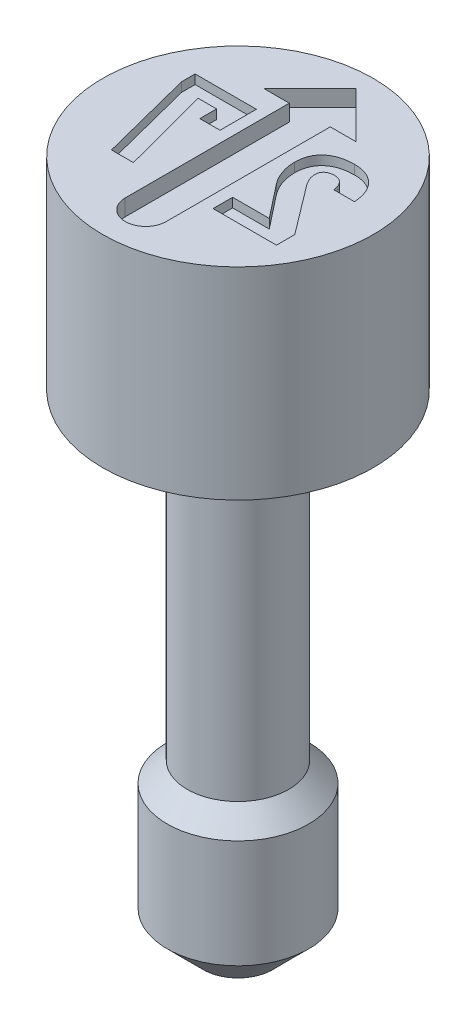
from build123d import *

# Parameters (mm, degrees)
CUT_EXTRUDE1_DEPTH = 0.4064
CUT_EXTRUDE2_DEPTH = 0.2286


with BuildPart() as part:
    # Sketch1 → Revolve1 (revolve)
    with BuildSketch(Plane.XY, mode=Mode.PRIVATE) as revolve1_sk:
        Polygon((0, 17.018), (3.3528, 17.018), (3.3528, 12.0142), (1.2573, 12.0142), (1.2573, 4.064), (1.7526, 3.5687), (1.7526, 0.889), (0.8636, 0), (0, 0), align=None)
    revolve(revolve1_sk.sketch.rotate(Axis((0, 0, 0), (0, 1, 0)), 90), axis=Axis((0, 0, 0), (0, 1, 0)))

    # Sketch2 → Cut-Extrude1 (cut)
    with BuildSketch(Plane(origin=(0, 17.018, 0), x_dir=(1, 0, 0), z_dir=(0, 1, 0))):
        with BuildLine():
            Line((0.508, -2.286), (0.508, 1.778))
            Line((0.508, 1.778), (1.143, 1.778))
            Line((1.143, 1.778), (0, 2.921))
            Line((0, 2.921), (-1.143, 1.778))
            Line((-1.143, 1.778), (-0.508, 1.778))
            Line((-0.508, 1.778), (-0.508, -2.286))
            ThreePointArc((-0.508, -2.286), (0, -2.794), (0.508, -2.286))
        make_face()
    extrude(amount=-CUT_EXTRUDE1_DEPTH, mode=Mode.SUBTRACT)

    # Sketch3 → Cut-Extrude2 (cut)
    with BuildSketch(Plane(origin=(0, 17.018, 0), x_dir=(1, 0, 0), z_dir=(0, 1, 0))):
        with BuildLine():
            Line((2.379759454, -1.427185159), (2.379759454, -0.973665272))
            Line((2.379759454, -0.973665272), (1.468390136, 0.233736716))
            add(Edge.make_bspline(
                [(1.468390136, 0.233736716), (1.449301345, 0.260633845), (1.412107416, 0.313042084), (1.378444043, 0.385014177), (1.357473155, 0.441441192), (1.347478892, 0.482361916), (1.340349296, 0.521404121), (1.339471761, 0.547058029), (1.339044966, 0.559535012)],
                knots=[0, 0, 0, 0, 1.664252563, 3.24274559, 3.998498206, 4.704056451, 5.369707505, 6, 6, 6, 6], degree=3))
            Line((1.339044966, 0.559535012), (1.339044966, 0.563323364))
            add(Edge.make_bspline(
                [(1.339044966, 0.563323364), (1.339784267, 0.580375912), (1.341200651, 0.613045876), (1.354545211, 0.659078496), (1.376416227, 0.699165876), (1.407740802, 0.73227792), (1.4467375, 0.758467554), (1.493398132, 0.776924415), (1.547112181, 0.787508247), (1.585238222, 0.78884061), (1.605312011, 0.789542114)],
                knots=[0, 0, 0, 0, 1.029992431, 1.973301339, 2.872554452, 3.768620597, 4.704316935, 5.693697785, 6.785705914, 8, 8, 8, 8], degree=3))
            add(Edge.make_bspline(
                [(1.605312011, 0.789542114), (1.624918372, 0.78877707), (1.663014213, 0.787290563), (1.71694537, 0.770815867), (1.7655426, 0.744974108), (1.807437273, 0.708101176), (1.842129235, 0.661805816), (1.87028512, 0.607289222), (1.889408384, 0.54356712), (1.896172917, 0.497952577), (1.899721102, 0.474026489)],
                knots=[0, 0, 0, 0, 0.980828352, 1.905783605, 2.800718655, 3.724477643, 4.680224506, 5.688112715, 6.78735127, 8, 8, 8, 8], degree=3))
            Line((1.899721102, 0.474026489), (1.899721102, 0.47240291))
            Line((1.899721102, 0.47240291), (2.412772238, 0.47240291))
            Line((2.412772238, 0.47240291), (2.412772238, 0.474026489))
            add(Edge.make_bspline(
                [(2.412772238, 0.474026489), (2.410240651, 0.504940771), (2.405299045, 0.565284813), (2.389098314, 0.652575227), (2.368159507, 0.734796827), (2.341522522, 0.811933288), (2.307293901, 0.883091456), (2.268837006, 0.949758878), (2.222582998, 1.00987356), (2.171951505, 1.065447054), (2.115557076, 1.114395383), (2.055425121, 1.157574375), (1.990646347, 1.193506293), (1.922205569, 1.223313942), (1.849343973, 1.245937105), (1.773013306, 1.262883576), (1.692337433, 1.272656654), (1.637268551, 1.273843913), (1.609100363, 1.274451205)],
                knots=[0, 0, 0, 0, 1.173229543, 2.290119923, 3.354877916, 4.382703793, 5.372196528, 6.339367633, 7.289741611, 8.236749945, 9.180232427, 10.11040526, 11.033485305, 11.978374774, 12.930610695, 13.916256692, 14.93414813, 16, 16, 16, 16], degree=3))
            add(Edge.make_bspline(
                [(1.609100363, 1.274451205), (1.578769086, 1.274020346), (1.519778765, 1.273182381), (1.433899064, 1.264136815), (1.353095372, 1.250484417), (1.277497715, 1.230511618), (1.207409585, 1.204458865), (1.142621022, 1.173045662), (1.082996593, 1.136004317), (1.028992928, 1.093255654), (0.980402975, 1.045576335), (0.938580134, 0.992482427), (0.902375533, 0.935047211), (0.874074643, 0.872156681), (0.850775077, 0.805289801), (0.835688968, 0.733247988), (0.825522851, 0.656879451), (0.824402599, 0.604309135), (0.823829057, 0.577394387)],
                knots=[0, 0, 0, 0, 1.219700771, 2.37215663, 3.469774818, 4.513610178, 5.512457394, 6.473141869, 7.405450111, 8.330272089, 9.238546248, 10.1372905, 11.043445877, 11.962355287, 12.905558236, 13.886315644, 14.917844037, 16, 16, 16, 16], degree=3))
            Line((0.823829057, 0.577394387), (0.823829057, 0.575229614))
            add(Edge.make_bspline(
                [(0.823829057, 0.575229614), (0.82451906, 0.544884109), (0.825900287, 0.48413948), (0.838368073, 0.393226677), (0.858459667, 0.302778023), (0.886052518, 0.213230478), (0.920329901, 0.126135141), (0.961469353, 0.042684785), (1.007900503, -0.037157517), (1.044692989, -0.086435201), (1.063036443, -0.11100334)],
                knots=[0, 0, 0, 0, 0.984368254, 1.970475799, 2.971844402, 3.988480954, 5.008197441, 6.005725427, 7.005724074, 8, 8, 8, 8], degree=3))
            Line((1.063036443, -0.11100334), (1.716797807, -0.942276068))
            Line((1.716797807, -0.942276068), (0.809216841, -0.942276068))
            Line((0.809216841, -0.942276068), (0.809216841, -1.427185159))
            Line((0.809216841, -1.427185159), (2.379759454, -1.427185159))
        make_face()
        Polygon((-2.302362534, 1.239814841), (-2.302362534, 0.905357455), (-1.707050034, -1.427185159), (-1.164774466, -1.427185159), (-1.741686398, 0.754905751), (-1.285460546, 0.754905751), (-1.285460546, 0.339269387), (-0.784856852, 0.339269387), (-0.784856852, 1.239814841), align=None)
    extrude(amount=-CUT_EXTRUDE2_DEPTH, mode=Mode.SUBTRACT)


solid = part.part
